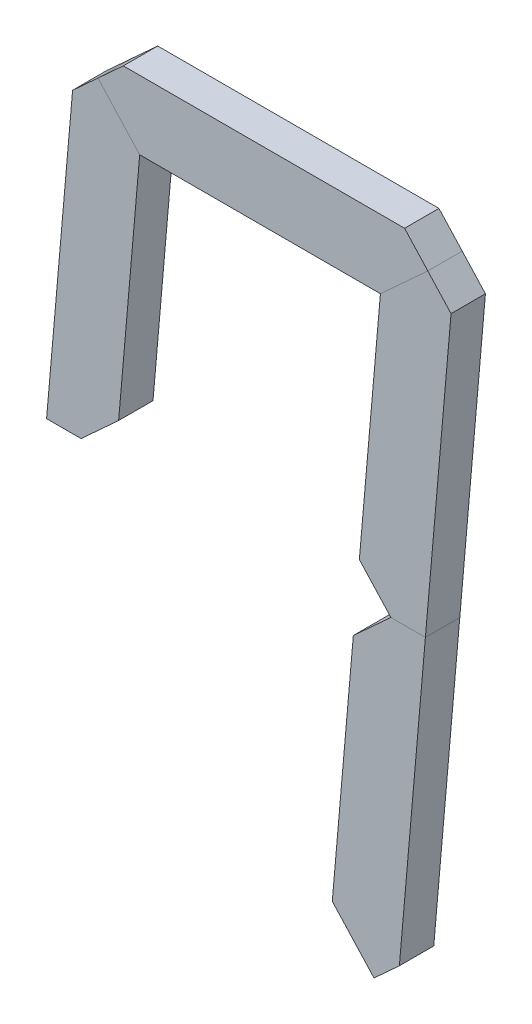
from build123d import *

# Parameters (mm, degrees)
AUFSATZ_LIN_UN_START    = -0.5
AUFSATZ_LIN_UN_DEPTH    = 0.5
AUFSATZ_LIN_LI_START    = -0.5
AUFSATZ_LIN_LI_UN_DEPTH = 0.5
AUFSATZ_LIN_RE_START    = -0.5
AUFSATZ_LIN_RE_UN_DEPTH = 0.5
AUFSATZ_LIN_MI_START    = -0.5
AUFSATZ_LIN_MI_DEPTH    = 0.5
KREISMUSTER_OB_COUNT    = 2


with BuildPart() as part:
    # Un → Aufsatz-Lin_Un (new body)
    with BuildSketch(Plane.XY.offset(AUFSATZ_LIN_UN_START)):
        Polygon((-2.451169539, -5), (1.638205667, -5), (2.006844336, -4.662204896), (1.400045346, -4), (-2.099954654, -4), (-2.788964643, -4.631361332), align=None)
    extrude(amount=AUFSATZ_LIN_UN_DEPTH)


with BuildPart() as body_2:
    # Li un → Aufsatz-Lin_Li un (new body)
    with BuildSketch(Plane.XY.offset(AUFSATZ_LIN_LI_START)):
        Polygon((-3.126759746, -4.262722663), (-2.753819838, 0), (-2.251909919, 0), (-1.793744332, -0.5), (-2.099954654, -4), (-2.788964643, -4.631361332), align=None)
    extrude(amount=AUFSATZ_LIN_LI_UN_DEPTH)


with BuildPart() as body_3:
    # Re un → Aufsatz-Lin_Re un (new body)
    with BuildSketch(Plane.XY.offset(AUFSATZ_LIN_RE_START)):
        Polygon((1.400045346, -4), (1.706255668, -0.5), (2.251909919, 0), (2.753819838, 0), (2.375483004, -4.324409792), (2.006844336, -4.662204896), align=None)
    extrude(amount=AUFSATZ_LIN_RE_UN_DEPTH)


with BuildPart() as body_4:
    # Mi → Aufsatz-Lin_Mi (new body)
    with BuildSketch(Plane.XY.offset(AUFSATZ_LIN_MI_START)):
        Polygon((-1.793744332, -0.5), (1.706255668, -0.5), (2.251909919, 0), (1.793744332, 0.5), (-1.706255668, 0.5), (-2.251909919, 0), align=None)
    extrude(amount=AUFSATZ_LIN_MI_DEPTH)


with BuildPart() as kreismuster_ob_1:
    # Kreismuster_Ob: pattern copy
    add(body_3.part.rotate(Axis((0, 0, 0), (0, 0, 1)), 1 * 360 / KREISMUSTER_OB_COUNT))


with BuildPart() as kreismuster_ob_2:
    # Kreismuster_Ob: pattern copy
    add(body_2.part.rotate(Axis((0, 0, 0), (0, 0, 1)), 1 * 360 / KREISMUSTER_OB_COUNT))


with BuildPart() as kreismuster_ob_3:
    # Kreismuster_Ob: pattern copy
    add(part.part.rotate(Axis((0, 0, 0), (0, 0, 1)), 1 * 360 / KREISMUSTER_OB_COUNT))


solid = Compound([body_3.part, kreismuster_ob_1.part, kreismuster_ob_2.part, kreismuster_ob_3.part])
